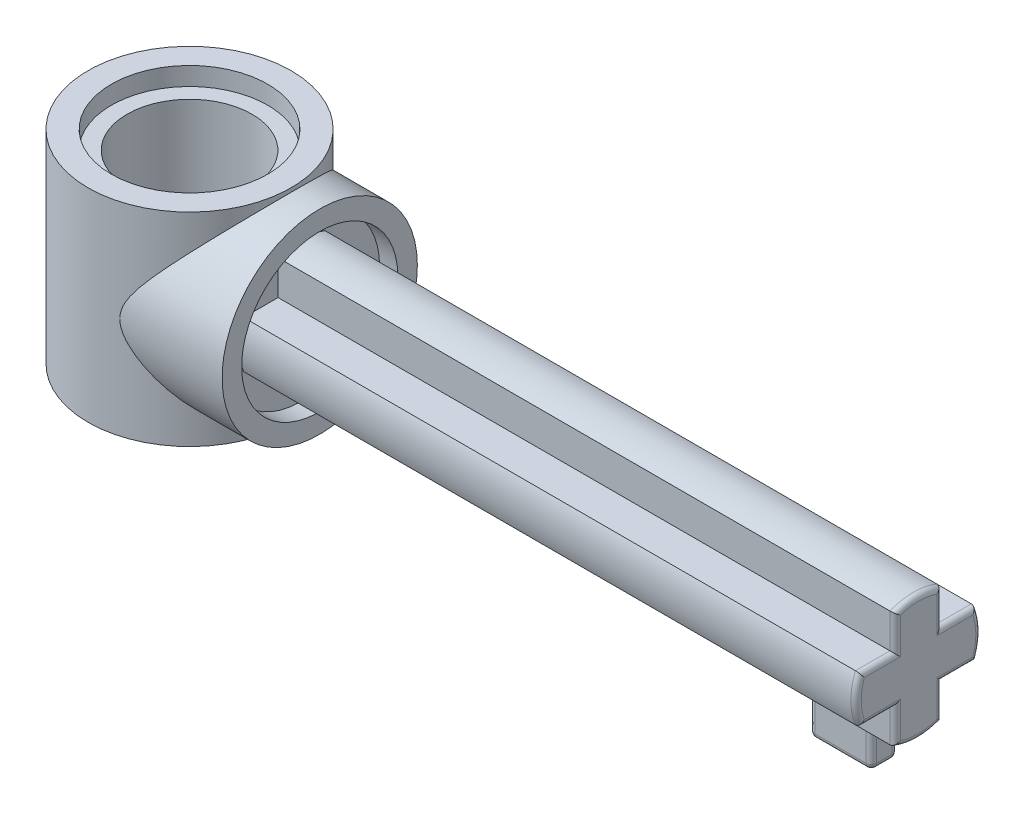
from build123d import *

# Parameters (mm, degrees)
SKETCH1_R                = 3.9
BOSS_EXTRUDE1_DEPTH      = 7.8
SKETCH2_R                = 3
CUT_EXTRUDE1_DEPTH       = 0.7
CUT_EXTRUDE2_START       = -0.7
SKETCH3_R                = 3
CUT_EXTRUDE2_DEPTH       = 0.7
SKETCH4_R                = 2.4
CUT_EXTRUDE3_DEPTH       = 10.553009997
BOSS_EXTRUDE2_REACH      = 14.46
BOSS_EXTRUDE2_END_RADIUS = 3.9
SKETCH6_R                = 3.75
SKETCH10_R               = 3
CUT_EXTRUDE7_DEPTH       = 0.7
BOSS_EXTRUDE3_DEPTH      = 23.7
FILLET1_R                = 0.2
BOSS_EXTRUDE4_REACH      = 31.327
BOSS_EXTRUDE4_END_RADIUS = 2.4
SKETCH13_W               = 2.370284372
SKETCH13_H               = 1
FILLET2_R                = 0.2


with BuildPart() as part:
    # Sketch1 → Boss-Extrude1 (new body)
    with BuildSketch(Plane(origin=(0, 0, 0), x_dir=(1, 0, 0), z_dir=(0, 1, 0))):
        with Locations(Location((0, 0, 0), (0, 0, 270))):
            Circle(SKETCH1_R)
    extrude(amount=BOSS_EXTRUDE1_DEPTH)

    # Sketch2 → Cut-Extrude1 (cut)
    with BuildSketch(Plane(origin=(0, 7.8, 0), x_dir=(1, 0, 0), z_dir=(0, 1, 0))):
        with Locations(Location((0, 0, 0), (0, 0, 270))):
            Circle(SKETCH2_R)
    extrude(amount=-CUT_EXTRUDE1_DEPTH, mode=Mode.SUBTRACT)

    # Sketch3 → Cut-Extrude2 (cut)
    with BuildSketch(Plane.XZ.offset(CUT_EXTRUDE2_START)):
        with Locations(Location((0, 0, 0), (0, 0, 90))):
            Circle(SKETCH3_R)
    extrude(amount=CUT_EXTRUDE2_DEPTH, mode=Mode.SUBTRACT)

    # Sketch4 → Cut-Extrude3 (cut, through all)
    with BuildSketch(Plane.XZ):
        with Locations(Location((0, 0, 0), (0, 0, 270))):
            Circle(SKETCH4_R)
    extrude(amount=-CUT_EXTRUDE3_DEPTH, mode=Mode.SUBTRACT)

    # Boss-Extrude2: up to this cylinder (the profile starts outside it)
    boss_extrude2_end = Plane(origin=(0, 3.9, 0), z_dir=(0, -1, 0)) * Cylinder(BOSS_EXTRUDE2_END_RADIUS, 37.72, mode=Mode.PRIVATE)
    # Sketch6 → Boss-Extrude2 (add, up to the surface)
    with BuildSketch(Plane(origin=(5, 0, 0), x_dir=(0, 0, -1), z_dir=(1, 0, 0)), mode=Mode.PRIVATE) as boss_extrude2_sk1:
        with Locations((0, 3.9)):
            Circle(SKETCH6_R)
    boss_extrude2_tool1 = extrude(boss_extrude2_sk1.sketch, amount=-BOSS_EXTRUDE2_REACH, mode=Mode.PRIVATE) - boss_extrude2_end
    add(boss_extrude2_tool1.solids().sort_by_distance((5, 3.9, 0))[0])

    # Sketch10 → Cut-Extrude7 (cut)
    with BuildSketch(Plane(origin=(5, 0, 0), x_dir=(0, 0, -1), z_dir=(1, 0, 0))):
        with Locations((0, 3.9)):
            Circle(SKETCH10_R)
    extrude(amount=-CUT_EXTRUDE7_DEPTH, mode=Mode.SUBTRACT)

    # Sketch12 → Boss-Extrude3 (add)
    with BuildSketch(Plane(origin=(28, 0, 0), x_dir=(0, 0, -1), z_dir=(1, 0, 0))):
        with BuildLine():
            Line((-2.224859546, 4.8), (-0.9, 4.8))
            Line((-0.9, 4.8), (-0.9, 6.124859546))
            ThreePointArc((-0.9, 6.124859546), (0, 6.3), (0.9, 6.124859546))
            Line((0.9, 6.124859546), (0.9, 4.8))
            Line((0.9, 4.8), (2.224859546, 4.8))
            ThreePointArc((2.224859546, 4.8), (2.4, 3.9), (2.224859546, 3))
            Line((2.224859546, 3), (0.9, 3))
            Line((0.9, 3), (0.9, 1.675140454))
            ThreePointArc((0.9, 1.675140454), (0, 1.5), (-0.9, 1.675140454))
            Line((-0.9, 1.675140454), (-0.9, 3))
            Line((-0.9, 3), (-2.224859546, 3))
            ThreePointArc((-2.224859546, 3), (-2.4, 3.9), (-2.224859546, 4.8))
        make_face()
    extrude(amount=-BOSS_EXTRUDE3_DEPTH)

    # Fillet1
    fillet1_edges = [part.edges().sort_by_distance(p)[0] for p in [
        (28, 5.462429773, 0.9),
        (28, 4.8, 1.562429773),
        (28, 3.9, 2.4),
        (28, 3, 1.562429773),
        (28, 2.337570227, 0.9),
        (28, 1.5, 0),
        (28, 2.337570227, -0.9),
        (28, 3, -1.562429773),
        (28, 3.9, -2.4),
        (28, 4.8, -1.562429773),
        (28, 5.462429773, -0.9),
        (28, 6.3, 0),
    ]]
    fillet(fillet1_edges, radius=FILLET1_R)

    # Boss-Extrude4: up to this cylinder (the profile starts outside it)
    boss_extrude4_end = Plane(origin=(25.5, 3.9, 0), z_dir=(1, 0, 0)) * Cylinder(BOSS_EXTRUDE4_END_RADIUS, 68.454, mode=Mode.PRIVATE)
    # Sketch13 → Boss-Extrude4 (add, up to the surface)
    with BuildSketch(Plane(origin=(0, 0, 0), x_dir=(1, 0, 0), z_dir=(0, 1, 0)), mode=Mode.PRIVATE) as boss_extrude4_sk1:
        with Locations((25.5, 0)):
            Rectangle(SKETCH13_W, SKETCH13_H)
    boss_extrude4_tool1 = extrude(boss_extrude4_sk1.sketch, amount=BOSS_EXTRUDE4_REACH, mode=Mode.PRIVATE) - boss_extrude4_end
    add(boss_extrude4_tool1.solids().sort_by_distance((25.5, 0, 0))[0])

    # Fillet2
    fillet2_edges = [part.edges().sort_by_distance(p)[0] for p in [
        (24.314857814, 1.5, 0),
        (24.314857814, 0.776330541, -0.5),
        (24.314857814, 0, 0),
        (25.5, 1.552661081, -0.5),
        (26.685142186, 0.776330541, -0.5),
        (25.5, 0, -0.5),
        (26.685142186, 1.5, 0),
        (26.685142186, 0.776330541, 0.5),
        (26.685142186, 0, 0),
        (25.5, 1.552661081, 0.5),
        (24.314857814, 0.776330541, 0.5),
        (25.5, 0, 0.5),
    ]]
    fillet(fillet2_edges, radius=FILLET2_R)


solid = part.part
